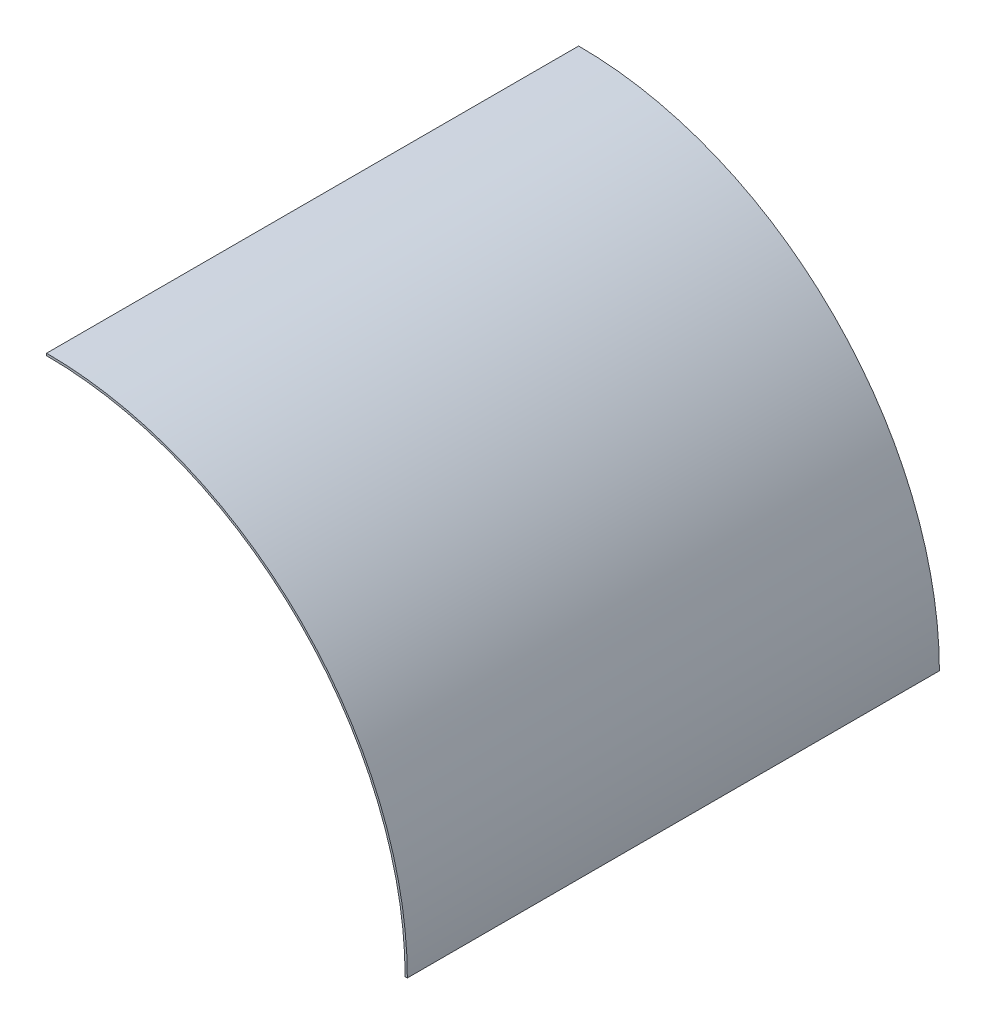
ISO-10303-21;
HEADER;
FILE_DESCRIPTION(('STEP AP214'),'2;1');
FILE_NAME('part.step','',(''),(''),'','','');
FILE_SCHEMA(('AUTOMOTIVE_DESIGN { 1 0 10303 214 1 1 1 1 }'));
ENDSEC;
DATA;
#1=APPLICATION_CONTEXT('core data for automotive mechanical design processes');
#2=APPLICATION_PROTOCOL_DEFINITION('international standard','automotive_design',2000,#1);
#3=PRODUCT_CONTEXT('',#1,'mechanical');
#4=PRODUCT('Part','Part','',(#3));
#5=PRODUCT_RELATED_PRODUCT_CATEGORY('part','',(#4));
#6=PRODUCT_DEFINITION_FORMATION('','',#4);
#7=PRODUCT_DEFINITION_CONTEXT('part definition',#1,'design');
#8=PRODUCT_DEFINITION('design','',#6,#7);
#9=PRODUCT_DEFINITION_SHAPE('','',#8);
#10=(LENGTH_UNIT() NAMED_UNIT(*) SI_UNIT(.MILLI.,.METRE.));
#11=(NAMED_UNIT(*) PLANE_ANGLE_UNIT() SI_UNIT($,.RADIAN.));
#12=(NAMED_UNIT(*) SI_UNIT($,.STERADIAN.) SOLID_ANGLE_UNIT());
#13=UNCERTAINTY_MEASURE_WITH_UNIT(LENGTH_MEASURE(1.E-05),#10,'distance_accuracy_value','');
#14=(GEOMETRIC_REPRESENTATION_CONTEXT(3) GLOBAL_UNCERTAINTY_ASSIGNED_CONTEXT((#13)) GLOBAL_UNIT_ASSIGNED_CONTEXT((#10,
#11,#12)) REPRESENTATION_CONTEXT('',''));
#15=CARTESIAN_POINT('',(0.,0.,0.));
#16=DIRECTION('',(0.,0.,1.));
#17=DIRECTION('',(1.,0.,0.));
#18=AXIS2_PLACEMENT_3D('',#15,#16,#17);
#19=CARTESIAN_POINT('',(0.,0.,-3000.));
#20=DIRECTION('',(0.,0.,1.));
#21=DIRECTION('',(1.,0.,0.));
#22=AXIS2_PLACEMENT_3D('',#19,#20,#21);
#23=CYLINDRICAL_SURFACE('',#22,2021.5);
#24=CARTESIAN_POINT('',(0.,0.,0.));
#25=DIRECTION('',(0.,0.,-1.));
#26=DIRECTION('',(-1.,0.,0.));
#27=AXIS2_PLACEMENT_3D('',#24,#25,#26);
#28=CIRCLE('',#27,2021.5);
#29=CARTESIAN_POINT('',(0.,2021.5,0.));
#30=VERTEX_POINT('',#29);
#31=CARTESIAN_POINT('',(2021.5,0.,0.));
#32=VERTEX_POINT('',#31);
#33=EDGE_CURVE('E101',#30,#32,#28,.T.);
#34=ORIENTED_EDGE('',*,*,#33,.F.);
#35=DIRECTION('',(0.,0.,1.));
#36=VECTOR('',#35,1.);
#37=CARTESIAN_POINT('',(0.,2021.5,-3000.));
#38=LINE('',#37,#36);
#39=CARTESIAN_POINT('',(0.,2021.5,-3000.));
#40=VERTEX_POINT('',#39);
#41=EDGE_CURVE('E11',#40,#30,#38,.T.);
#42=ORIENTED_EDGE('',*,*,#41,.F.);
#43=CARTESIAN_POINT('',(0.,0.,-3000.));
#44=DIRECTION('',(0.,0.,-1.));
#45=DIRECTION('',(-1.,0.,0.));
#46=AXIS2_PLACEMENT_3D('',#43,#44,#45);
#47=CIRCLE('',#46,2021.5);
#48=CARTESIAN_POINT('',(2021.5,0.,-3000.));
#49=VERTEX_POINT('',#48);
#50=EDGE_CURVE('E95',#40,#49,#47,.T.);
#51=ORIENTED_EDGE('',*,*,#50,.T.);
#52=DIRECTION('',(0.,0.,1.));
#53=VECTOR('',#52,1.);
#54=CARTESIAN_POINT('',(2021.5,0.,-3000.));
#55=LINE('',#54,#53);
#56=EDGE_CURVE('E40',#49,#32,#55,.T.);
#57=ORIENTED_EDGE('',*,*,#56,.T.);
#58=EDGE_LOOP('',(#34,#42,#51,#57));
#59=FACE_BOUND('',#58,.T.);
#60=ADVANCED_FACE('F37',(#59),#23,.F.);
#61=CARTESIAN_POINT('',(0.,2034.,-3000.));
#62=DIRECTION('',(-1.,0.,0.));
#63=DIRECTION('',(0.,0.,1.));
#64=AXIS2_PLACEMENT_3D('',#61,#62,#63);
#65=PLANE('',#64);
#66=DIRECTION('',(0.,-1.,0.));
#67=VECTOR('',#66,1.);
#68=CARTESIAN_POINT('',(0.,2034.,0.));
#69=LINE('',#68,#67);
#70=CARTESIAN_POINT('',(0.,2034.,0.));
#71=VERTEX_POINT('',#70);
#72=EDGE_CURVE('E97',#71,#30,#69,.T.);
#73=ORIENTED_EDGE('',*,*,#72,.F.);
#74=DIRECTION('',(0.,0.,1.));
#75=VECTOR('',#74,1.);
#76=CARTESIAN_POINT('',(0.,2034.,-3000.));
#77=LINE('',#76,#75);
#78=CARTESIAN_POINT('',(0.,2034.,-3000.));
#79=VERTEX_POINT('',#78);
#80=EDGE_CURVE('E46',#79,#71,#77,.T.);
#81=ORIENTED_EDGE('',*,*,#80,.F.);
#82=DIRECTION('',(0.,-1.,0.));
#83=VECTOR('',#82,1.);
#84=CARTESIAN_POINT('',(0.,2034.,-3000.));
#85=LINE('',#84,#83);
#86=EDGE_CURVE('E92',#79,#40,#85,.T.);
#87=ORIENTED_EDGE('',*,*,#86,.T.);
#88=ORIENTED_EDGE('',*,*,#41,.T.);
#89=EDGE_LOOP('',(#73,#81,#87,#88));
#90=FACE_BOUND('',#89,.T.);
#91=ADVANCED_FACE('F111',(#90),#65,.T.);
#92=CARTESIAN_POINT('',(0.,0.,-3000.));
#93=DIRECTION('',(0.,0.,1.));
#94=DIRECTION('',(1.,0.,0.));
#95=AXIS2_PLACEMENT_3D('',#92,#93,#94);
#96=CYLINDRICAL_SURFACE('',#95,2034.);
#97=CARTESIAN_POINT('',(0.,0.,0.));
#98=DIRECTION('',(0.,0.,1.));
#99=DIRECTION('',(-1.,0.,0.));
#100=AXIS2_PLACEMENT_3D('',#97,#98,#99);
#101=CIRCLE('',#100,2034.);
#102=CARTESIAN_POINT('',(2034.,2.49093158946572E-13,0.));
#103=VERTEX_POINT('',#102);
#104=EDGE_CURVE('E87',#103,#71,#101,.T.);
#105=ORIENTED_EDGE('',*,*,#104,.F.);
#106=DIRECTION('',(0.,0.,1.));
#107=VECTOR('',#106,1.);
#108=CARTESIAN_POINT('',(2034.,2.49093158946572E-13,-3000.));
#109=LINE('',#108,#107);
#110=CARTESIAN_POINT('',(2034.,2.49093158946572E-13,-3000.));
#111=VERTEX_POINT('',#110);
#112=EDGE_CURVE('E82',#111,#103,#109,.T.);
#113=ORIENTED_EDGE('',*,*,#112,.F.);
#114=CARTESIAN_POINT('',(0.,0.,-3000.));
#115=DIRECTION('',(0.,0.,1.));
#116=DIRECTION('',(-1.,0.,0.));
#117=AXIS2_PLACEMENT_3D('',#114,#115,#116);
#118=CIRCLE('',#117,2034.);
#119=EDGE_CURVE('E85',#111,#79,#118,.T.);
#120=ORIENTED_EDGE('',*,*,#119,.T.);
#121=ORIENTED_EDGE('',*,*,#80,.T.);
#122=EDGE_LOOP('',(#105,#113,#120,#121));
#123=FACE_BOUND('',#122,.T.);
#124=ADVANCED_FACE('F84',(#123),#96,.T.);
#125=CARTESIAN_POINT('',(2034.,0.,-3000.));
#126=DIRECTION('',(0.,-1.,0.));
#127=DIRECTION('',(0.,0.,-1.));
#128=AXIS2_PLACEMENT_3D('',#125,#126,#127);
#129=PLANE('',#128);
#130=DIRECTION('',(1.,0.,0.));
#131=VECTOR('',#130,1.);
#132=CARTESIAN_POINT('',(2034.,0.,0.));
#133=LINE('',#132,#131);
#134=EDGE_CURVE('E104',#32,#103,#133,.T.);
#135=ORIENTED_EDGE('',*,*,#134,.F.);
#136=ORIENTED_EDGE('',*,*,#56,.F.);
#137=DIRECTION('',(1.,0.,0.));
#138=VECTOR('',#137,1.);
#139=CARTESIAN_POINT('',(2034.,0.,-3000.));
#140=LINE('',#139,#138);
#141=EDGE_CURVE('E91',#49,#111,#140,.T.);
#142=ORIENTED_EDGE('',*,*,#141,.T.);
#143=ORIENTED_EDGE('',*,*,#112,.T.);
#144=EDGE_LOOP('',(#135,#136,#142,#143));
#145=FACE_BOUND('',#144,.T.);
#146=ADVANCED_FACE('F94',(#145),#129,.T.);
#147=CARTESIAN_POINT('',(0.,0.,-3000.));
#148=DIRECTION('',(0.,0.,-1.));
#149=DIRECTION('',(-1.,0.,0.));
#150=AXIS2_PLACEMENT_3D('',#147,#148,#149);
#151=PLANE('',#150);
#152=ORIENTED_EDGE('',*,*,#50,.F.);
#153=ORIENTED_EDGE('',*,*,#86,.F.);
#154=ORIENTED_EDGE('',*,*,#119,.F.);
#155=ORIENTED_EDGE('',*,*,#141,.F.);
#156=EDGE_LOOP('',(#152,#153,#154,#155));
#157=FACE_BOUND('',#156,.T.);
#158=ADVANCED_FACE('F90',(#157),#151,.T.);
#159=CARTESIAN_POINT('',(0.,0.,0.));
#160=DIRECTION('',(0.,0.,-1.));
#161=DIRECTION('',(-1.,0.,0.));
#162=AXIS2_PLACEMENT_3D('',#159,#160,#161);
#163=PLANE('',#162);
#164=ORIENTED_EDGE('',*,*,#33,.T.);
#165=ORIENTED_EDGE('',*,*,#134,.T.);
#166=ORIENTED_EDGE('',*,*,#104,.T.);
#167=ORIENTED_EDGE('',*,*,#72,.T.);
#168=EDGE_LOOP('',(#164,#165,#166,#167));
#169=FACE_BOUND('',#168,.T.);
#170=ADVANCED_FACE('F110',(#169),#163,.F.);
#171=CLOSED_SHELL('',(#60,#91,#124,#146,#158,#170));
#172=MANIFOLD_SOLID_BREP('B2',#171);
#173=ADVANCED_BREP_SHAPE_REPRESENTATION('',(#18,#172),#14);
#174=SHAPE_DEFINITION_REPRESENTATION(#9,#173);
ENDSEC;
END-ISO-10303-21;
